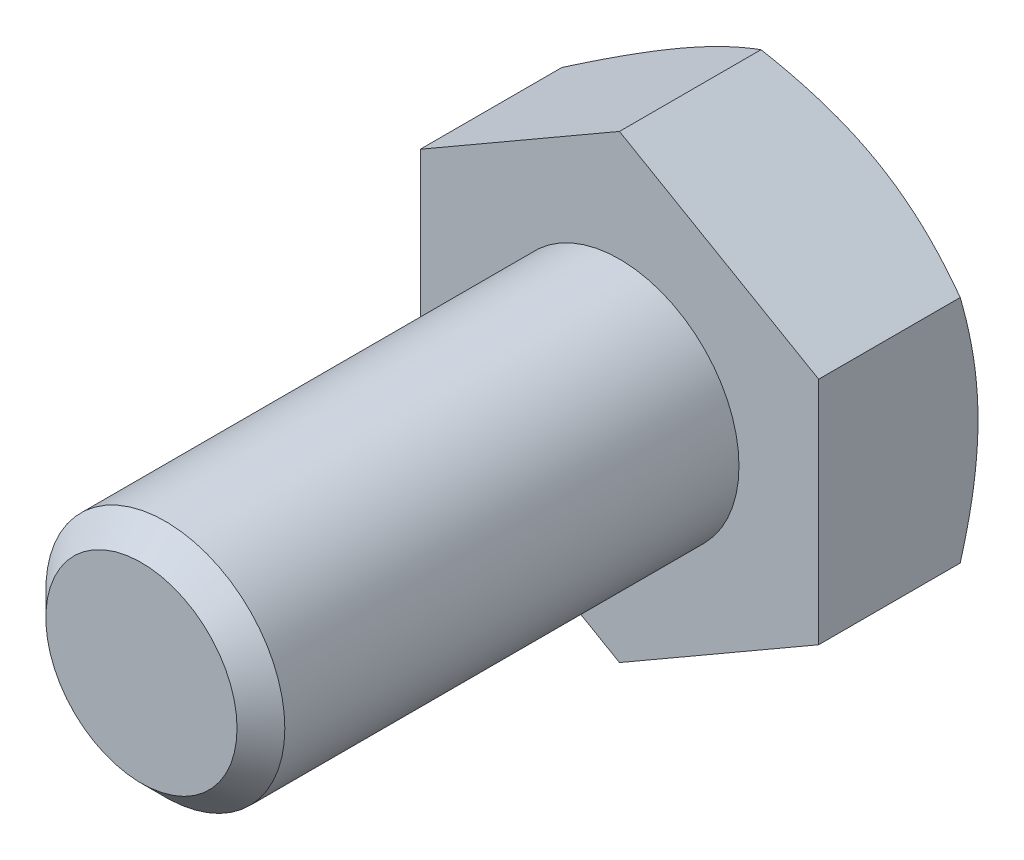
from build123d import *

# Parameters (mm, degrees)
ESQUISSE1_W        = 3
ESQUISSE1_H        = 12
CHANFREIN1_SIZE    = 0.6
BOSS_EXTRU_1_DEPTH = 4


with BuildPart() as part:
    # Esquisse1 → Base-R_volution (revolve)
    with BuildSketch(Plane(origin=(0, 0, 0), x_dir=(1, 0, 0), z_dir=(0, 1, 0))):
        with Locations((1.5, -6)):
            Rectangle(ESQUISSE1_W, ESQUISSE1_H)
    revolve(axis=Axis((0, 0, 0), (0, 0, 1)))

    # Chanfrein1
    chanfrein1_edges = [part.edges().sort_by_distance(p)[0] for p in [
        (-3, 0, 12),
    ]]
    chamfer(chanfrein1_edges, length=CHANFREIN1_SIZE)

    # Esquisse6 → Boss.-Extru.1 (add)
    with BuildSketch(Plane.XY):
        Polygon((5, -2.886751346), (5, 2.886751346), (0, 5.773502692), (-5, 2.886751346), (-5, -2.886751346), (0, -5.773502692), align=None)
    extrude(amount=-BOSS_EXTRU_1_DEPTH)

    # Esquisse7 → Enl_vement de mati_re-R_volution1 (revolve, cut)
    with BuildSketch(Plane(origin=(0, 0, 0), x_dir=(1, 0, 0), z_dir=(0, 1, 0))):
        Polygon((-5, 4), (-11.92820323, 4), (-11.92820323, 0), align=None)
    revolve(axis=Axis((0, 0, -6.239446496), (0, 0, 1)), mode=Mode.SUBTRACT)


solid = part.part
